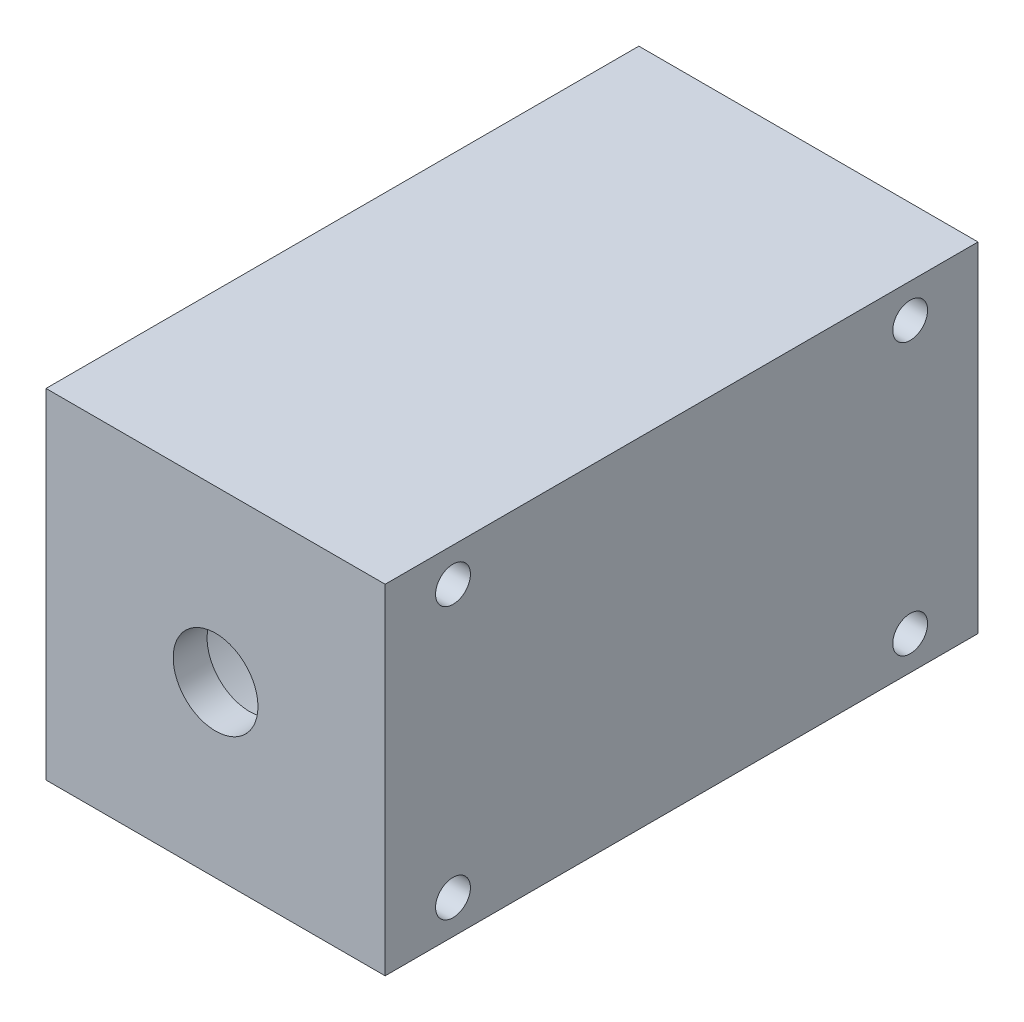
ISO-10303-21;
HEADER;
FILE_DESCRIPTION(('STEP AP214'),'2;1');
FILE_NAME('part.step','',(''),(''),'','','');
FILE_SCHEMA(('AUTOMOTIVE_DESIGN { 1 0 10303 214 1 1 1 1 }'));
ENDSEC;
DATA;
#1=APPLICATION_CONTEXT('core data for automotive mechanical design processes');
#2=APPLICATION_PROTOCOL_DEFINITION('international standard','automotive_design',2000,#1);
#3=PRODUCT_CONTEXT('',#1,'mechanical');
#4=PRODUCT('Part','Part','',(#3));
#5=PRODUCT_RELATED_PRODUCT_CATEGORY('part','',(#4));
#6=PRODUCT_DEFINITION_FORMATION('','',#4);
#7=PRODUCT_DEFINITION_CONTEXT('part definition',#1,'design');
#8=PRODUCT_DEFINITION('design','',#6,#7);
#9=PRODUCT_DEFINITION_SHAPE('','',#8);
#10=(LENGTH_UNIT() NAMED_UNIT(*) SI_UNIT(.MILLI.,.METRE.));
#11=(NAMED_UNIT(*) PLANE_ANGLE_UNIT() SI_UNIT($,.RADIAN.));
#12=(NAMED_UNIT(*) SI_UNIT($,.STERADIAN.) SOLID_ANGLE_UNIT());
#13=UNCERTAINTY_MEASURE_WITH_UNIT(LENGTH_MEASURE(1.E-05),#10,'distance_accuracy_value','');
#14=(GEOMETRIC_REPRESENTATION_CONTEXT(3) GLOBAL_UNCERTAINTY_ASSIGNED_CONTEXT((#13)) GLOBAL_UNIT_ASSIGNED_CONTEXT((#10,
#11,#12)) REPRESENTATION_CONTEXT('',''));
#15=CARTESIAN_POINT('',(0.,0.,0.));
#16=DIRECTION('',(0.,0.,1.));
#17=DIRECTION('',(1.,0.,0.));
#18=AXIS2_PLACEMENT_3D('',#15,#16,#17);
#19=CARTESIAN_POINT('',(0.,63.5,-110.998));
#20=DIRECTION('',(-1.,0.,0.));
#21=DIRECTION('',(0.,-1.,0.));
#22=AXIS2_PLACEMENT_3D('',#19,#20,#21);
#23=PLANE('',#22);
#24=DIRECTION('',(0.,-1.,0.));
#25=VECTOR('',#24,1.);
#26=CARTESIAN_POINT('',(0.,63.5,0.));
#27=LINE('',#26,#25);
#28=CARTESIAN_POINT('',(0.,63.5,0.));
#29=VERTEX_POINT('',#28);
#30=CARTESIAN_POINT('',(0.,0.,0.));
#31=VERTEX_POINT('',#30);
#32=EDGE_CURVE('E133',#29,#31,#27,.T.);
#33=ORIENTED_EDGE('',*,*,#32,.F.);
#34=DIRECTION('',(0.,0.,1.));
#35=VECTOR('',#34,1.);
#36=CARTESIAN_POINT('',(0.,63.5,-110.998));
#37=LINE('',#36,#35);
#38=CARTESIAN_POINT('',(0.,63.5,-110.998));
#39=VERTEX_POINT('',#38);
#40=EDGE_CURVE('E41',#39,#29,#37,.T.);
#41=ORIENTED_EDGE('',*,*,#40,.F.);
#42=DIRECTION('',(0.,-1.,0.));
#43=VECTOR('',#42,1.);
#44=CARTESIAN_POINT('',(0.,63.5,-110.998));
#45=LINE('',#44,#43);
#46=CARTESIAN_POINT('',(0.,0.,-110.998));
#47=VERTEX_POINT('',#46);
#48=EDGE_CURVE('E134',#39,#47,#45,.T.);
#49=ORIENTED_EDGE('',*,*,#48,.T.);
#50=DIRECTION('',(0.,0.,1.));
#51=VECTOR('',#50,1.);
#52=CARTESIAN_POINT('',(0.,0.,-110.998));
#53=LINE('',#52,#51);
#54=EDGE_CURVE('E77',#47,#31,#53,.T.);
#55=ORIENTED_EDGE('',*,*,#54,.T.);
#56=EDGE_LOOP('',(#33,#41,#49,#55));
#57=FACE_BOUND('',#56,.T.);
#58=ADVANCED_FACE('F33',(#57),#23,.T.);
#59=CARTESIAN_POINT('',(0.,63.5,-110.998));
#60=DIRECTION('',(0.,1.,0.));
#61=DIRECTION('',(-1.,0.,0.));
#62=AXIS2_PLACEMENT_3D('',#59,#60,#61);
#63=PLANE('',#62);
#64=DIRECTION('',(-1.,0.,0.));
#65=VECTOR('',#64,1.);
#66=CARTESIAN_POINT('',(0.,63.5,0.));
#67=LINE('',#66,#65);
#68=CARTESIAN_POINT('',(63.5,63.5,0.));
#69=VERTEX_POINT('',#68);
#70=EDGE_CURVE('E137',#69,#29,#67,.T.);
#71=ORIENTED_EDGE('',*,*,#70,.F.);
#72=DIRECTION('',(0.,0.,1.));
#73=VECTOR('',#72,1.);
#74=CARTESIAN_POINT('',(63.5,63.5,-110.998));
#75=LINE('',#74,#73);
#76=CARTESIAN_POINT('',(63.5,63.5,-110.998));
#77=VERTEX_POINT('',#76);
#78=EDGE_CURVE('E66',#77,#69,#75,.T.);
#79=ORIENTED_EDGE('',*,*,#78,.F.);
#80=DIRECTION('',(-1.,0.,0.));
#81=VECTOR('',#80,1.);
#82=CARTESIAN_POINT('',(0.,63.5,-110.998));
#83=LINE('',#82,#81);
#84=EDGE_CURVE('E141',#77,#39,#83,.T.);
#85=ORIENTED_EDGE('',*,*,#84,.T.);
#86=ORIENTED_EDGE('',*,*,#40,.T.);
#87=EDGE_LOOP('',(#71,#79,#85,#86));
#88=FACE_BOUND('',#87,.T.);
#89=ADVANCED_FACE('F159',(#88),#63,.T.);
#90=CARTESIAN_POINT('',(63.5,63.5,-110.998));
#91=DIRECTION('',(1.,0.,0.));
#92=DIRECTION('',(0.,1.,0.));
#93=AXIS2_PLACEMENT_3D('',#90,#91,#92);
#94=PLANE('',#93);
#95=CARTESIAN_POINT('',(63.5,57.15,-98.298));
#96=DIRECTION('',(1.,0.,0.));
#97=DIRECTION('',(0.,0.,-1.));
#98=AXIS2_PLACEMENT_3D('',#95,#96,#97);
#99=CIRCLE('',#98,3.2639);
#100=CARTESIAN_POINT('',(63.5,57.15,-101.5619));
#101=VERTEX_POINT('',#100);
#102=EDGE_CURVE('E101',#101,#101,#99,.T.);
#103=ORIENTED_EDGE('',*,*,#102,.F.);
#104=EDGE_LOOP('',(#103));
#105=FACE_BOUND('',#104,.T.);
#106=CARTESIAN_POINT('',(63.5,6.35,-98.298));
#107=DIRECTION('',(1.,0.,0.));
#108=DIRECTION('',(0.,0.,-1.));
#109=AXIS2_PLACEMENT_3D('',#106,#107,#108);
#110=CIRCLE('',#109,3.2639);
#111=CARTESIAN_POINT('',(63.5,6.35,-101.5619));
#112=VERTEX_POINT('',#111);
#113=EDGE_CURVE('E109',#112,#112,#110,.T.);
#114=ORIENTED_EDGE('',*,*,#113,.F.);
#115=EDGE_LOOP('',(#114));
#116=FACE_BOUND('',#115,.T.);
#117=CARTESIAN_POINT('',(63.5,57.15,-12.7));
#118=DIRECTION('',(1.,0.,0.));
#119=DIRECTION('',(0.,0.,-1.));
#120=AXIS2_PLACEMENT_3D('',#117,#118,#119);
#121=CIRCLE('',#120,3.2639);
#122=CARTESIAN_POINT('',(63.5,57.15,-15.9639));
#123=VERTEX_POINT('',#122);
#124=EDGE_CURVE('E115',#123,#123,#121,.T.);
#125=ORIENTED_EDGE('',*,*,#124,.F.);
#126=EDGE_LOOP('',(#125));
#127=FACE_BOUND('',#126,.T.);
#128=CARTESIAN_POINT('',(63.5,6.35,-12.7));
#129=DIRECTION('',(1.,0.,0.));
#130=DIRECTION('',(0.,0.,-1.));
#131=AXIS2_PLACEMENT_3D('',#128,#129,#130);
#132=CIRCLE('',#131,3.2639);
#133=CARTESIAN_POINT('',(63.5,6.35,-15.9639));
#134=VERTEX_POINT('',#133);
#135=EDGE_CURVE('E121',#134,#134,#132,.T.);
#136=ORIENTED_EDGE('',*,*,#135,.F.);
#137=EDGE_LOOP('',(#136));
#138=FACE_BOUND('',#137,.T.);
#139=DIRECTION('',(0.,1.,0.));
#140=VECTOR('',#139,1.);
#141=CARTESIAN_POINT('',(63.5,63.5,0.));
#142=LINE('',#141,#140);
#143=CARTESIAN_POINT('',(63.5,0.,0.));
#144=VERTEX_POINT('',#143);
#145=EDGE_CURVE('E148',#144,#69,#142,.T.);
#146=ORIENTED_EDGE('',*,*,#145,.F.);
#147=DIRECTION('',(0.,0.,1.));
#148=VECTOR('',#147,1.);
#149=CARTESIAN_POINT('',(63.5,0.,-110.998));
#150=LINE('',#149,#148);
#151=CARTESIAN_POINT('',(63.5,0.,-110.998));
#152=VERTEX_POINT('',#151);
#153=EDGE_CURVE('E154',#152,#144,#150,.T.);
#154=ORIENTED_EDGE('',*,*,#153,.F.);
#155=DIRECTION('',(0.,1.,0.));
#156=VECTOR('',#155,1.);
#157=CARTESIAN_POINT('',(63.5,63.5,-110.998));
#158=LINE('',#157,#156);
#159=EDGE_CURVE('E139',#152,#77,#158,.T.);
#160=ORIENTED_EDGE('',*,*,#159,.T.);
#161=ORIENTED_EDGE('',*,*,#78,.T.);
#162=EDGE_LOOP('',(#146,#154,#160,#161));
#163=FACE_BOUND('',#162,.T.);
#164=ADVANCED_FACE('F162',(#105,#116,#127,#138,#163),#94,.T.);
#165=CARTESIAN_POINT('',(0.,0.,-110.998));
#166=DIRECTION('',(0.,-1.,0.));
#167=DIRECTION('',(0.,0.,-1.));
#168=AXIS2_PLACEMENT_3D('',#165,#166,#167);
#169=PLANE('',#168);
#170=DIRECTION('',(1.,0.,0.));
#171=VECTOR('',#170,1.);
#172=CARTESIAN_POINT('',(0.,0.,0.));
#173=LINE('',#172,#171);
#174=EDGE_CURVE('E145',#31,#144,#173,.T.);
#175=ORIENTED_EDGE('',*,*,#174,.F.);
#176=ORIENTED_EDGE('',*,*,#54,.F.);
#177=DIRECTION('',(1.,0.,0.));
#178=VECTOR('',#177,1.);
#179=CARTESIAN_POINT('',(0.,0.,-110.998));
#180=LINE('',#179,#178);
#181=EDGE_CURVE('E136',#47,#152,#180,.T.);
#182=ORIENTED_EDGE('',*,*,#181,.T.);
#183=ORIENTED_EDGE('',*,*,#153,.T.);
#184=EDGE_LOOP('',(#175,#176,#182,#183));
#185=FACE_BOUND('',#184,.T.);
#186=ADVANCED_FACE('F155',(#185),#169,.T.);
#187=CARTESIAN_POINT('',(0.,0.,-110.998));
#188=DIRECTION('',(0.,0.,1.));
#189=DIRECTION('',(1.,0.,0.));
#190=AXIS2_PLACEMENT_3D('',#187,#188,#189);
#191=PLANE('',#190);
#192=ORIENTED_EDGE('',*,*,#48,.F.);
#193=ORIENTED_EDGE('',*,*,#84,.F.);
#194=ORIENTED_EDGE('',*,*,#159,.F.);
#195=ORIENTED_EDGE('',*,*,#181,.F.);
#196=EDGE_LOOP('',(#192,#193,#194,#195));
#197=FACE_BOUND('',#196,.T.);
#198=ADVANCED_FACE('F164',(#197),#191,.F.);
#199=CARTESIAN_POINT('',(0.,0.,0.));
#200=DIRECTION('',(0.,0.,1.));
#201=DIRECTION('',(1.,0.,0.));
#202=AXIS2_PLACEMENT_3D('',#199,#200,#201);
#203=PLANE('',#202);
#204=ORIENTED_EDGE('',*,*,#32,.T.);
#205=ORIENTED_EDGE('',*,*,#174,.T.);
#206=ORIENTED_EDGE('',*,*,#145,.T.);
#207=ORIENTED_EDGE('',*,*,#70,.T.);
#208=EDGE_LOOP('',(#204,#205,#206,#207));
#209=FACE_BOUND('',#208,.T.);
#210=CARTESIAN_POINT('',(31.75,31.75,0.));
#211=DIRECTION('',(0.,0.,1.));
#212=DIRECTION('',(1.,0.,0.));
#213=AXIS2_PLACEMENT_3D('',#210,#211,#212);
#214=CIRCLE('',#213,7.9375);
#215=CARTESIAN_POINT('',(39.6875,31.75,0.));
#216=VERTEX_POINT('',#215);
#217=EDGE_CURVE('E124',#216,#216,#214,.T.);
#218=ORIENTED_EDGE('',*,*,#217,.F.);
#219=EDGE_LOOP('',(#218));
#220=FACE_BOUND('',#219,.T.);
#221=ADVANCED_FACE('F157',(#209,#220),#203,.T.);
#222=CARTESIAN_POINT('',(31.75,31.75,-6.35));
#223=DIRECTION('',(0.,0.,1.));
#224=DIRECTION('',(1.,0.,0.));
#225=AXIS2_PLACEMENT_3D('',#222,#223,#224);
#226=PLANE('',#225);
#227=CARTESIAN_POINT('',(31.75,31.75,-6.35));
#228=DIRECTION('',(0.,0.,1.));
#229=DIRECTION('',(1.,0.,0.));
#230=AXIS2_PLACEMENT_3D('',#227,#228,#229);
#231=CIRCLE('',#230,7.9375);
#232=CARTESIAN_POINT('',(39.6875,31.75,-6.35));
#233=VERTEX_POINT('',#232);
#234=EDGE_CURVE('E125',#233,#233,#231,.T.);
#235=ORIENTED_EDGE('',*,*,#234,.T.);
#236=EDGE_LOOP('',(#235));
#237=FACE_BOUND('',#236,.T.);
#238=CARTESIAN_POINT('',(31.75,31.75,-6.34999999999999));
#239=DIRECTION('',(0.,0.,1.));
#240=DIRECTION('',(1.,0.,0.));
#241=AXIS2_PLACEMENT_3D('',#238,#239,#240);
#242=CIRCLE('',#241,25.4);
#243=CARTESIAN_POINT('',(57.15,31.75,-6.34999999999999));
#244=VERTEX_POINT('',#243);
#245=EDGE_CURVE('E11',#244,#244,#242,.F.);
#246=ORIENTED_EDGE('',*,*,#245,.T.);
#247=EDGE_LOOP('',(#246));
#248=FACE_BOUND('',#247,.T.);
#249=ADVANCED_FACE('F171',(#237,#248),#226,.F.);
#250=CARTESIAN_POINT('',(31.75,31.75,-6.35));
#251=DIRECTION('',(0.,0.,1.));
#252=DIRECTION('',(1.,0.,0.));
#253=AXIS2_PLACEMENT_3D('',#250,#251,#252);
#254=CYLINDRICAL_SURFACE('',#253,7.9375);
#255=ORIENTED_EDGE('',*,*,#234,.F.);
#256=EDGE_LOOP('',(#255));
#257=FACE_BOUND('',#256,.T.);
#258=ORIENTED_EDGE('',*,*,#217,.T.);
#259=EDGE_LOOP('',(#258));
#260=FACE_BOUND('',#259,.T.);
#261=ADVANCED_FACE('F212',(#257,#260),#254,.F.);
#262=CARTESIAN_POINT('',(31.75,31.75,-104.648));
#263=DIRECTION('',(0.,0.,1.));
#264=DIRECTION('',(1.,0.,0.));
#265=AXIS2_PLACEMENT_3D('',#262,#263,#264);
#266=PLANE('',#265);
#267=CARTESIAN_POINT('',(31.75,31.75,-104.648));
#268=DIRECTION('',(0.,0.,1.));
#269=DIRECTION('',(1.,0.,0.));
#270=AXIS2_PLACEMENT_3D('',#267,#268,#269);
#271=CIRCLE('',#270,25.4);
#272=CARTESIAN_POINT('',(57.15,31.75,-104.648));
#273=VERTEX_POINT('',#272);
#274=EDGE_CURVE('E128',#273,#273,#271,.T.);
#275=ORIENTED_EDGE('',*,*,#274,.T.);
#276=EDGE_LOOP('',(#275));
#277=FACE_BOUND('',#276,.T.);
#278=ADVANCED_FACE('F207',(#277),#266,.T.);
#279=CARTESIAN_POINT('',(31.75,31.75,-104.648));
#280=DIRECTION('',(0.,0.,1.));
#281=DIRECTION('',(1.,0.,0.));
#282=AXIS2_PLACEMENT_3D('',#279,#280,#281);
#283=CYLINDRICAL_SURFACE('',#282,25.4);
#284=ORIENTED_EDGE('',*,*,#274,.F.);
#285=EDGE_LOOP('',(#284));
#286=FACE_BOUND('',#285,.T.);
#287=ORIENTED_EDGE('',*,*,#245,.F.);
#288=EDGE_LOOP('',(#287));
#289=FACE_BOUND('',#288,.T.);
#290=ADVANCED_FACE('F197',(#286,#289),#283,.F.);
#291=CARTESIAN_POINT('',(63.5,6.35,-12.7));
#292=DIRECTION('',(1.,0.,0.));
#293=DIRECTION('',(0.,0.,-1.));
#294=AXIS2_PLACEMENT_3D('',#291,#292,#293);
#295=CYLINDRICAL_SURFACE('',#294,3.2639);
#296=CARTESIAN_POINT('',(50.8,6.35,-12.7));
#297=DIRECTION('',(1.,0.,0.));
#298=DIRECTION('',(0.,0.,-1.));
#299=AXIS2_PLACEMENT_3D('',#296,#297,#298);
#300=CIRCLE('',#299,3.2639);
#301=CARTESIAN_POINT('',(50.8,6.35,-15.9639));
#302=VERTEX_POINT('',#301);
#303=EDGE_CURVE('E118',#302,#302,#300,.T.);
#304=ORIENTED_EDGE('',*,*,#303,.F.);
#305=EDGE_LOOP('',(#304));
#306=FACE_BOUND('',#305,.T.);
#307=ORIENTED_EDGE('',*,*,#135,.T.);
#308=EDGE_LOOP('',(#307));
#309=FACE_BOUND('',#308,.T.);
#310=ADVANCED_FACE('F194',(#306,#309),#295,.F.);
#311=CARTESIAN_POINT('',(50.8,6.35,-12.7));
#312=DIRECTION('',(1.,0.,0.));
#313=DIRECTION('',(0.,0.,-1.));
#314=AXIS2_PLACEMENT_3D('',#311,#312,#313);
#315=CONICAL_SURFACE('',#314,3.2639,1.02974425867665);
#316=CARTESIAN_POINT('',(48.8388510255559,6.35,-12.7));
#317=VERTEX_POINT('',#316);
#318=VERTEX_LOOP('',#317);
#319=FACE_BOUND('',#318,.T.);
#320=ORIENTED_EDGE('',*,*,#303,.T.);
#321=EDGE_LOOP('',(#320));
#322=FACE_BOUND('',#321,.T.);
#323=ADVANCED_FACE('F196',(#319,#322),#315,.F.);
#324=CARTESIAN_POINT('',(63.5,57.15,-12.7));
#325=DIRECTION('',(1.,0.,0.));
#326=DIRECTION('',(0.,0.,-1.));
#327=AXIS2_PLACEMENT_3D('',#324,#325,#326);
#328=CYLINDRICAL_SURFACE('',#327,3.2639);
#329=CARTESIAN_POINT('',(50.8,57.15,-12.7));
#330=DIRECTION('',(1.,0.,0.));
#331=DIRECTION('',(0.,0.,-1.));
#332=AXIS2_PLACEMENT_3D('',#329,#330,#331);
#333=CIRCLE('',#332,3.26389999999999);
#334=CARTESIAN_POINT('',(50.8,57.15,-15.9639));
#335=VERTEX_POINT('',#334);
#336=EDGE_CURVE('E112',#335,#335,#333,.T.);
#337=ORIENTED_EDGE('',*,*,#336,.F.);
#338=EDGE_LOOP('',(#337));
#339=FACE_BOUND('',#338,.T.);
#340=ORIENTED_EDGE('',*,*,#124,.T.);
#341=EDGE_LOOP('',(#340));
#342=FACE_BOUND('',#341,.T.);
#343=ADVANCED_FACE('F204',(#339,#342),#328,.F.);
#344=CARTESIAN_POINT('',(50.8,57.15,-12.7));
#345=DIRECTION('',(1.,0.,0.));
#346=DIRECTION('',(0.,0.,-1.));
#347=AXIS2_PLACEMENT_3D('',#344,#345,#346);
#348=CONICAL_SURFACE('',#347,3.26389999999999,1.02974425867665);
#349=CARTESIAN_POINT('',(48.8388510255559,57.15,-12.7));
#350=VERTEX_POINT('',#349);
#351=VERTEX_LOOP('',#350);
#352=FACE_BOUND('',#351,.T.);
#353=ORIENTED_EDGE('',*,*,#336,.T.);
#354=EDGE_LOOP('',(#353));
#355=FACE_BOUND('',#354,.T.);
#356=ADVANCED_FACE('F260',(#352,#355),#348,.F.);
#357=CARTESIAN_POINT('',(63.5,6.35,-98.298));
#358=DIRECTION('',(1.,0.,0.));
#359=DIRECTION('',(0.,0.,-1.));
#360=AXIS2_PLACEMENT_3D('',#357,#358,#359);
#361=CYLINDRICAL_SURFACE('',#360,3.2639);
#362=CARTESIAN_POINT('',(50.8,6.35,-98.298));
#363=DIRECTION('',(1.,0.,0.));
#364=DIRECTION('',(0.,0.,-1.));
#365=AXIS2_PLACEMENT_3D('',#362,#363,#364);
#366=CIRCLE('',#365,3.2639);
#367=CARTESIAN_POINT('',(50.8,6.35,-101.5619));
#368=VERTEX_POINT('',#367);
#369=EDGE_CURVE('E104',#368,#368,#366,.T.);
#370=ORIENTED_EDGE('',*,*,#369,.F.);
#371=EDGE_LOOP('',(#370));
#372=FACE_BOUND('',#371,.T.);
#373=ORIENTED_EDGE('',*,*,#113,.T.);
#374=EDGE_LOOP('',(#373));
#375=FACE_BOUND('',#374,.T.);
#376=ADVANCED_FACE('F268',(#372,#375),#361,.F.);
#377=CARTESIAN_POINT('',(50.8,6.35,-98.298));
#378=DIRECTION('',(1.,0.,0.));
#379=DIRECTION('',(0.,0.,-1.));
#380=AXIS2_PLACEMENT_3D('',#377,#378,#379);
#381=CONICAL_SURFACE('',#380,3.2639,1.02974425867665);
#382=CARTESIAN_POINT('',(48.8388510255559,6.35,-98.298));
#383=VERTEX_POINT('',#382);
#384=VERTEX_LOOP('',#383);
#385=FACE_BOUND('',#384,.T.);
#386=ORIENTED_EDGE('',*,*,#369,.T.);
#387=EDGE_LOOP('',(#386));
#388=FACE_BOUND('',#387,.T.);
#389=ADVANCED_FACE('F285',(#385,#388),#381,.F.);
#390=CARTESIAN_POINT('',(63.5,57.15,-98.298));
#391=DIRECTION('',(1.,0.,0.));
#392=DIRECTION('',(0.,0.,-1.));
#393=AXIS2_PLACEMENT_3D('',#390,#391,#392);
#394=CYLINDRICAL_SURFACE('',#393,3.2639);
#395=CARTESIAN_POINT('',(50.8,57.15,-98.298));
#396=DIRECTION('',(1.,0.,0.));
#397=DIRECTION('',(0.,0.,-1.));
#398=AXIS2_PLACEMENT_3D('',#395,#396,#397);
#399=CIRCLE('',#398,3.26389999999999);
#400=CARTESIAN_POINT('',(50.8,57.15,-101.5619));
#401=VERTEX_POINT('',#400);
#402=EDGE_CURVE('E99',#401,#401,#399,.T.);
#403=ORIENTED_EDGE('',*,*,#402,.F.);
#404=EDGE_LOOP('',(#403));
#405=FACE_BOUND('',#404,.T.);
#406=ORIENTED_EDGE('',*,*,#102,.T.);
#407=EDGE_LOOP('',(#406));
#408=FACE_BOUND('',#407,.T.);
#409=ADVANCED_FACE('F95',(#405,#408),#394,.F.);
#410=CARTESIAN_POINT('',(50.8,57.15,-98.298));
#411=DIRECTION('',(1.,0.,0.));
#412=DIRECTION('',(0.,0.,-1.));
#413=AXIS2_PLACEMENT_3D('',#410,#411,#412);
#414=CONICAL_SURFACE('',#413,3.26389999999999,1.02974425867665);
#415=CARTESIAN_POINT('',(48.8388510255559,57.15,-98.298));
#416=VERTEX_POINT('',#415);
#417=VERTEX_LOOP('',#416);
#418=FACE_BOUND('',#417,.T.);
#419=ORIENTED_EDGE('',*,*,#402,.T.);
#420=EDGE_LOOP('',(#419));
#421=FACE_BOUND('',#420,.T.);
#422=ADVANCED_FACE('F92',(#418,#421),#414,.F.);
#423=CLOSED_SHELL('',(#58,#89,#164,#186,#198,#221,#249,#261,#278,#290,#310,#323,#343,#356,#376,
#389,#409,#422));
#424=MANIFOLD_SOLID_BREP('B2',#423);
#425=ADVANCED_BREP_SHAPE_REPRESENTATION('',(#18,#424),#14);
#426=SHAPE_DEFINITION_REPRESENTATION(#9,#425);
ENDSEC;
END-ISO-10303-21;
